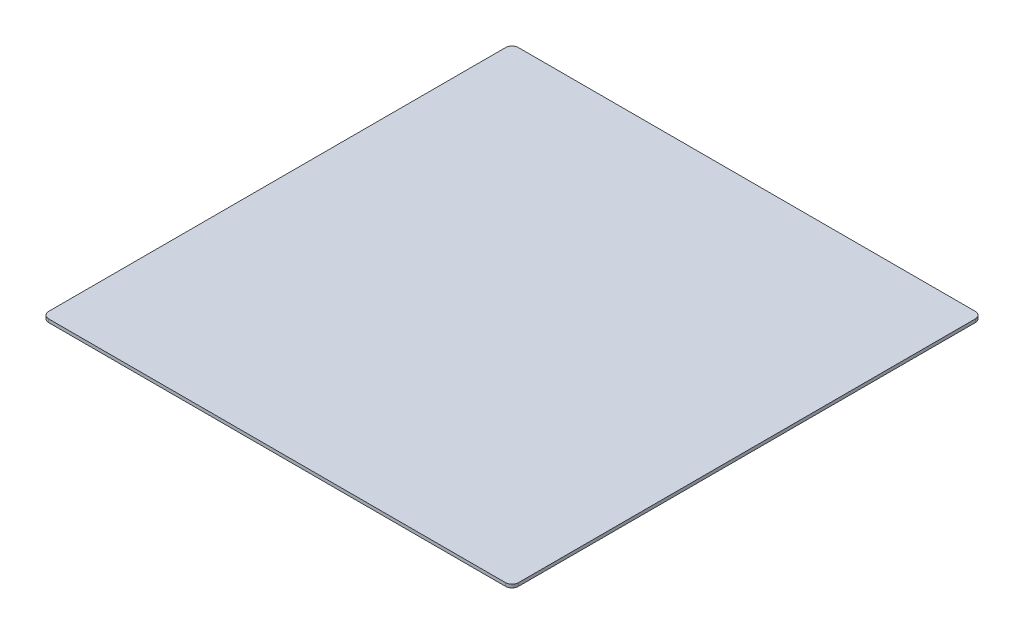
from build123d import *

# Parameters (mm, degrees)
SKETCH1_W           = 457.2
SKETCH1_H           = 457.2
BOSS_EXTRUDE1_DEPTH = 3.175
FILLET1_R           = 6.35


with BuildPart() as part:
    # Sketch1 → Boss-Extrude1 (new body)
    with BuildSketch(Plane(origin=(0, 0, 0), x_dir=(1, 0, 0), z_dir=(0, 1, 0))):
        Rectangle(SKETCH1_W, SKETCH1_H)
    extrude(amount=BOSS_EXTRUDE1_DEPTH)

    # Fillet1
    fillet1_edges = [part.edges().sort_by_distance(p)[0] for p in [
        (228.6, 1.5875, 228.6),
        (-228.6, 1.5875, 228.6),
        (-228.6, 1.5875, -228.6),
        (228.6, 1.5875, -228.6),
    ]]
    fillet(fillet1_edges, radius=FILLET1_R)


solid = part.part
